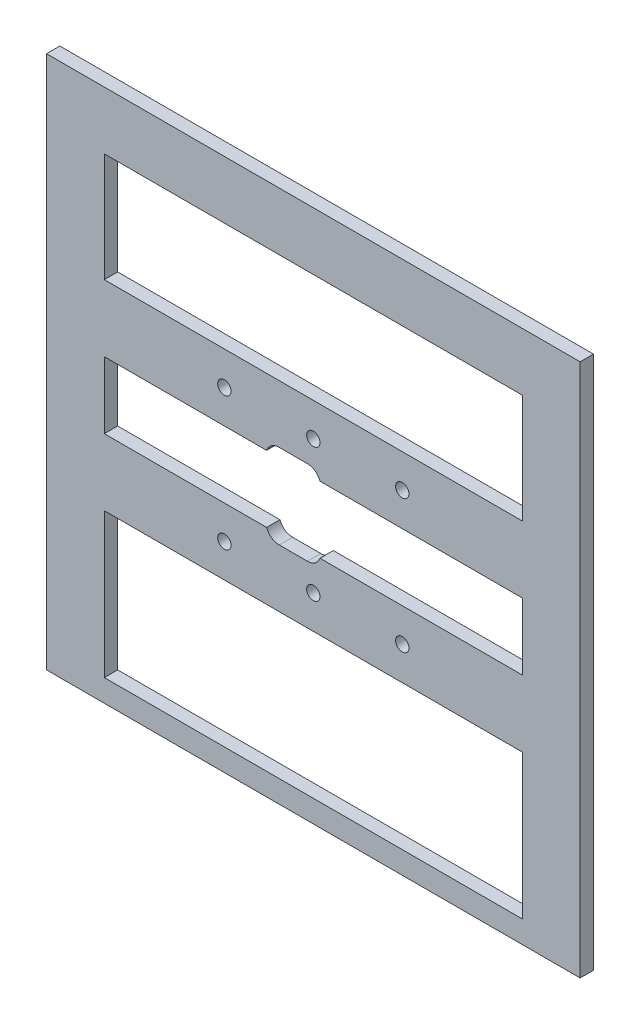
ISO-10303-21;
HEADER;
FILE_DESCRIPTION(('STEP AP214'),'2;1');
FILE_NAME('part.step','',(''),(''),'','','');
FILE_SCHEMA(('AUTOMOTIVE_DESIGN { 1 0 10303 214 1 1 1 1 }'));
ENDSEC;
DATA;
#1=APPLICATION_CONTEXT('core data for automotive mechanical design processes');
#2=APPLICATION_PROTOCOL_DEFINITION('international standard','automotive_design',2000,#1);
#3=PRODUCT_CONTEXT('',#1,'mechanical');
#4=PRODUCT('Part','Part','',(#3));
#5=PRODUCT_RELATED_PRODUCT_CATEGORY('part','',(#4));
#6=PRODUCT_DEFINITION_FORMATION('','',#4);
#7=PRODUCT_DEFINITION_CONTEXT('part definition',#1,'design');
#8=PRODUCT_DEFINITION('design','',#6,#7);
#9=PRODUCT_DEFINITION_SHAPE('','',#8);
#10=(LENGTH_UNIT() NAMED_UNIT(*) SI_UNIT(.MILLI.,.METRE.));
#11=(NAMED_UNIT(*) PLANE_ANGLE_UNIT() SI_UNIT($,.RADIAN.));
#12=(NAMED_UNIT(*) SI_UNIT($,.STERADIAN.) SOLID_ANGLE_UNIT());
#13=UNCERTAINTY_MEASURE_WITH_UNIT(LENGTH_MEASURE(1.E-05),#10,'distance_accuracy_value','');
#14=(GEOMETRIC_REPRESENTATION_CONTEXT(3) GLOBAL_UNCERTAINTY_ASSIGNED_CONTEXT((#13)) GLOBAL_UNIT_ASSIGNED_CONTEXT((#10,
#11,#12)) REPRESENTATION_CONTEXT('',''));
#15=CARTESIAN_POINT('',(0.,0.,0.));
#16=DIRECTION('',(0.,0.,1.));
#17=DIRECTION('',(1.,0.,0.));
#18=AXIS2_PLACEMENT_3D('',#15,#16,#17);
#19=CARTESIAN_POINT('',(-47.,7.5,0.));
#20=DIRECTION('',(0.,1.,0.));
#21=DIRECTION('',(0.,0.,1.));
#22=AXIS2_PLACEMENT_3D('',#19,#20,#21);
#23=PLANE('',#22);
#24=DIRECTION('',(-1.,0.,0.));
#25=VECTOR('',#24,1.);
#26=CARTESIAN_POINT('',(-47.,7.5,0.));
#27=LINE('',#26,#25);
#28=CARTESIAN_POINT('',(-10.5,7.5,0.));
#29=VERTEX_POINT('',#28);
#30=CARTESIAN_POINT('',(-47.,7.5,0.));
#31=VERTEX_POINT('',#30);
#32=EDGE_CURVE('E268',#29,#31,#27,.T.);
#33=ORIENTED_EDGE('',*,*,#32,.F.);
#34=DIRECTION('',(0.,0.,-1.));
#35=VECTOR('',#34,1.);
#36=CARTESIAN_POINT('',(-10.5,7.5,3.));
#37=LINE('',#36,#35);
#38=CARTESIAN_POINT('',(-10.5,7.5,3.));
#39=VERTEX_POINT('',#38);
#40=EDGE_CURVE('E248',#39,#29,#37,.T.);
#41=ORIENTED_EDGE('',*,*,#40,.F.);
#42=DIRECTION('',(-1.,0.,0.));
#43=VECTOR('',#42,1.);
#44=CARTESIAN_POINT('',(-47.,7.5,3.));
#45=LINE('',#44,#43);
#46=CARTESIAN_POINT('',(-47.,7.5,3.));
#47=VERTEX_POINT('',#46);
#48=EDGE_CURVE('E283',#39,#47,#45,.T.);
#49=ORIENTED_EDGE('',*,*,#48,.T.);
#50=DIRECTION('',(0.,0.,1.));
#51=VECTOR('',#50,1.);
#52=CARTESIAN_POINT('',(-47.,7.5,0.));
#53=LINE('',#52,#51);
#54=EDGE_CURVE('E300',#31,#47,#53,.T.);
#55=ORIENTED_EDGE('',*,*,#54,.F.);
#56=EDGE_LOOP('',(#33,#41,#49,#55));
#57=FACE_BOUND('',#56,.T.);
#58=ADVANCED_FACE('F35',(#57),#23,.F.);
#59=CARTESIAN_POINT('',(-47.,-7.5,0.));
#60=DIRECTION('',(0.,-1.,0.));
#61=DIRECTION('',(0.,0.,-1.));
#62=AXIS2_PLACEMENT_3D('',#59,#60,#61);
#63=PLANE('',#62);
#64=DIRECTION('',(1.,0.,0.));
#65=VECTOR('',#64,1.);
#66=CARTESIAN_POINT('',(-47.,-7.5,3.));
#67=LINE('',#66,#65);
#68=CARTESIAN_POINT('',(-47.,-7.5,3.));
#69=VERTEX_POINT('',#68);
#70=CARTESIAN_POINT('',(-10.5,-7.5,3.));
#71=VERTEX_POINT('',#70);
#72=EDGE_CURVE('E269',#69,#71,#67,.T.);
#73=ORIENTED_EDGE('',*,*,#72,.T.);
#74=DIRECTION('',(0.,0.,-1.));
#75=VECTOR('',#74,1.);
#76=CARTESIAN_POINT('',(-10.5,-7.5,3.));
#77=LINE('',#76,#75);
#78=CARTESIAN_POINT('',(-10.5,-7.5,0.));
#79=VERTEX_POINT('',#78);
#80=EDGE_CURVE('E257',#71,#79,#77,.T.);
#81=ORIENTED_EDGE('',*,*,#80,.T.);
#82=DIRECTION('',(1.,0.,0.));
#83=VECTOR('',#82,1.);
#84=CARTESIAN_POINT('',(-47.,-7.5,0.));
#85=LINE('',#84,#83);
#86=CARTESIAN_POINT('',(-47.,-7.5,0.));
#87=VERTEX_POINT('',#86);
#88=EDGE_CURVE('E277',#87,#79,#85,.T.);
#89=ORIENTED_EDGE('',*,*,#88,.F.);
#90=DIRECTION('',(0.,0.,1.));
#91=VECTOR('',#90,1.);
#92=CARTESIAN_POINT('',(-47.,-7.5,0.));
#93=LINE('',#92,#91);
#94=EDGE_CURVE('E298',#87,#69,#93,.T.);
#95=ORIENTED_EDGE('',*,*,#94,.T.);
#96=EDGE_LOOP('',(#73,#81,#89,#95));
#97=FACE_BOUND('',#96,.T.);
#98=ADVANCED_FACE('F451',(#97),#63,.F.);
#99=CARTESIAN_POINT('',(60.,60.,3.));
#100=DIRECTION('',(-1.,0.,0.));
#101=DIRECTION('',(0.,-1.,0.));
#102=AXIS2_PLACEMENT_3D('',#99,#100,#101);
#103=PLANE('',#102);
#104=DIRECTION('',(0.,1.,0.));
#105=VECTOR('',#104,1.);
#106=CARTESIAN_POINT('',(60.,60.,0.));
#107=LINE('',#106,#105);
#108=CARTESIAN_POINT('',(60.,-60.,0.));
#109=VERTEX_POINT('',#108);
#110=CARTESIAN_POINT('',(60.,60.,0.));
#111=VERTEX_POINT('',#110);
#112=EDGE_CURVE('E359',#109,#111,#107,.T.);
#113=ORIENTED_EDGE('',*,*,#112,.T.);
#114=DIRECTION('',(0.,0.,-1.));
#115=VECTOR('',#114,1.);
#116=CARTESIAN_POINT('',(60.,60.,3.));
#117=LINE('',#116,#115);
#118=CARTESIAN_POINT('',(60.,60.,3.));
#119=VERTEX_POINT('',#118);
#120=EDGE_CURVE('E386',#119,#111,#117,.T.);
#121=ORIENTED_EDGE('',*,*,#120,.F.);
#122=DIRECTION('',(0.,1.,0.));
#123=VECTOR('',#122,1.);
#124=CARTESIAN_POINT('',(60.,60.,3.));
#125=LINE('',#124,#123);
#126=CARTESIAN_POINT('',(60.,-60.,3.));
#127=VERTEX_POINT('',#126);
#128=EDGE_CURVE('E360',#127,#119,#125,.T.);
#129=ORIENTED_EDGE('',*,*,#128,.F.);
#130=DIRECTION('',(0.,0.,-1.));
#131=VECTOR('',#130,1.);
#132=CARTESIAN_POINT('',(60.,-60.,3.));
#133=LINE('',#132,#131);
#134=EDGE_CURVE('E370',#127,#109,#133,.T.);
#135=ORIENTED_EDGE('',*,*,#134,.T.);
#136=EDGE_LOOP('',(#113,#121,#129,#135));
#137=FACE_BOUND('',#136,.T.);
#138=ADVANCED_FACE('F469',(#137),#103,.F.);
#139=CARTESIAN_POINT('',(-60.,60.,3.));
#140=DIRECTION('',(0.,-1.,0.));
#141=DIRECTION('',(0.,0.,-1.));
#142=AXIS2_PLACEMENT_3D('',#139,#140,#141);
#143=PLANE('',#142);
#144=DIRECTION('',(-1.,0.,0.));
#145=VECTOR('',#144,1.);
#146=CARTESIAN_POINT('',(-60.,60.,0.));
#147=LINE('',#146,#145);
#148=CARTESIAN_POINT('',(-60.,60.,0.));
#149=VERTEX_POINT('',#148);
#150=EDGE_CURVE('E373',#111,#149,#147,.T.);
#151=ORIENTED_EDGE('',*,*,#150,.T.);
#152=DIRECTION('',(0.,0.,-1.));
#153=VECTOR('',#152,1.);
#154=CARTESIAN_POINT('',(-60.,60.,3.));
#155=LINE('',#154,#153);
#156=CARTESIAN_POINT('',(-60.,60.,3.));
#157=VERTEX_POINT('',#156);
#158=EDGE_CURVE('E383',#157,#149,#155,.T.);
#159=ORIENTED_EDGE('',*,*,#158,.F.);
#160=DIRECTION('',(-1.,0.,0.));
#161=VECTOR('',#160,1.);
#162=CARTESIAN_POINT('',(-60.,60.,3.));
#163=LINE('',#162,#161);
#164=EDGE_CURVE('E363',#119,#157,#163,.T.);
#165=ORIENTED_EDGE('',*,*,#164,.F.);
#166=ORIENTED_EDGE('',*,*,#120,.T.);
#167=EDGE_LOOP('',(#151,#159,#165,#166));
#168=FACE_BOUND('',#167,.T.);
#169=ADVANCED_FACE('F524',(#168),#143,.F.);
#170=CARTESIAN_POINT('',(-60.,60.,3.));
#171=DIRECTION('',(1.,0.,0.));
#172=DIRECTION('',(0.,1.,0.));
#173=AXIS2_PLACEMENT_3D('',#170,#171,#172);
#174=PLANE('',#173);
#175=DIRECTION('',(0.,-1.,0.));
#176=VECTOR('',#175,1.);
#177=CARTESIAN_POINT('',(-60.,60.,0.));
#178=LINE('',#177,#176);
#179=CARTESIAN_POINT('',(-60.,-60.,0.));
#180=VERTEX_POINT('',#179);
#181=EDGE_CURVE('E375',#149,#180,#178,.T.);
#182=ORIENTED_EDGE('',*,*,#181,.T.);
#183=DIRECTION('',(0.,0.,-1.));
#184=VECTOR('',#183,1.);
#185=CARTESIAN_POINT('',(-60.,-60.,3.));
#186=LINE('',#185,#184);
#187=CARTESIAN_POINT('',(-60.,-60.,3.));
#188=VERTEX_POINT('',#187);
#189=EDGE_CURVE('E380',#188,#180,#186,.T.);
#190=ORIENTED_EDGE('',*,*,#189,.F.);
#191=DIRECTION('',(0.,-1.,0.));
#192=VECTOR('',#191,1.);
#193=CARTESIAN_POINT('',(-60.,60.,3.));
#194=LINE('',#193,#192);
#195=EDGE_CURVE('E366',#157,#188,#194,.T.);
#196=ORIENTED_EDGE('',*,*,#195,.F.);
#197=ORIENTED_EDGE('',*,*,#158,.T.);
#198=EDGE_LOOP('',(#182,#190,#196,#197));
#199=FACE_BOUND('',#198,.T.);
#200=ADVANCED_FACE('F520',(#199),#174,.F.);
#201=CARTESIAN_POINT('',(-60.,-60.,3.));
#202=DIRECTION('',(0.,1.,0.));
#203=DIRECTION('',(0.,0.,1.));
#204=AXIS2_PLACEMENT_3D('',#201,#202,#203);
#205=PLANE('',#204);
#206=DIRECTION('',(1.,0.,0.));
#207=VECTOR('',#206,1.);
#208=CARTESIAN_POINT('',(-60.,-60.,0.));
#209=LINE('',#208,#207);
#210=EDGE_CURVE('E364',#180,#109,#209,.T.);
#211=ORIENTED_EDGE('',*,*,#210,.T.);
#212=ORIENTED_EDGE('',*,*,#134,.F.);
#213=DIRECTION('',(1.,0.,0.));
#214=VECTOR('',#213,1.);
#215=CARTESIAN_POINT('',(-60.,-60.,3.));
#216=LINE('',#215,#214);
#217=EDGE_CURVE('E368',#188,#127,#216,.T.);
#218=ORIENTED_EDGE('',*,*,#217,.F.);
#219=ORIENTED_EDGE('',*,*,#189,.T.);
#220=EDGE_LOOP('',(#211,#212,#218,#219));
#221=FACE_BOUND('',#220,.T.);
#222=ADVANCED_FACE('F513',(#221),#205,.F.);
#223=CARTESIAN_POINT('',(0.,0.,3.));
#224=DIRECTION('',(0.,0.,1.));
#225=DIRECTION('',(1.,0.,0.));
#226=AXIS2_PLACEMENT_3D('',#223,#224,#225);
#227=PLANE('',#226);
#228=CARTESIAN_POINT('',(0.,-15.,3.));
#229=DIRECTION('',(0.,0.,1.));
#230=DIRECTION('',(1.,0.,0.));
#231=AXIS2_PLACEMENT_3D('',#228,#229,#230);
#232=CIRCLE('',#231,1.49999999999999);
#233=CARTESIAN_POINT('',(1.49999999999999,-15.,3.));
#234=VERTEX_POINT('',#233);
#235=EDGE_CURVE('E659',#234,#234,#232,.T.);
#236=ORIENTED_EDGE('',*,*,#235,.F.);
#237=EDGE_LOOP('',(#236));
#238=FACE_BOUND('',#237,.T.);
#239=CARTESIAN_POINT('',(0.,15.,3.));
#240=DIRECTION('',(0.,0.,1.));
#241=DIRECTION('',(1.,0.,0.));
#242=AXIS2_PLACEMENT_3D('',#239,#240,#241);
#243=CIRCLE('',#242,1.49999999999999);
#244=CARTESIAN_POINT('',(1.49999999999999,15.,3.));
#245=VERTEX_POINT('',#244);
#246=EDGE_CURVE('E661',#245,#245,#243,.T.);
#247=ORIENTED_EDGE('',*,*,#246,.F.);
#248=EDGE_LOOP('',(#247));
#249=FACE_BOUND('',#248,.T.);
#250=DIRECTION('',(1.,0.,0.));
#251=VECTOR('',#250,1.);
#252=CARTESIAN_POINT('',(-47.,-55.,3.));
#253=LINE('',#252,#251);
#254=CARTESIAN_POINT('',(-47.,-55.,3.));
#255=VERTEX_POINT('',#254);
#256=CARTESIAN_POINT('',(47.,-55.,3.));
#257=VERTEX_POINT('',#256);
#258=EDGE_CURVE('E223',#255,#257,#253,.T.);
#259=ORIENTED_EDGE('',*,*,#258,.F.);
#260=DIRECTION('',(0.,-1.,0.));
#261=VECTOR('',#260,1.);
#262=CARTESIAN_POINT('',(-47.,-22.5,3.));
#263=LINE('',#262,#261);
#264=CARTESIAN_POINT('',(-47.,-22.5,3.));
#265=VERTEX_POINT('',#264);
#266=EDGE_CURVE('E214',#265,#255,#263,.T.);
#267=ORIENTED_EDGE('',*,*,#266,.F.);
#268=DIRECTION('',(-1.,0.,0.));
#269=VECTOR('',#268,1.);
#270=CARTESIAN_POINT('',(-47.,-22.5,3.));
#271=LINE('',#270,#269);
#272=CARTESIAN_POINT('',(47.,-22.5,3.));
#273=VERTEX_POINT('',#272);
#274=EDGE_CURVE('E208',#273,#265,#271,.T.);
#275=ORIENTED_EDGE('',*,*,#274,.F.);
#276=DIRECTION('',(0.,1.,0.));
#277=VECTOR('',#276,1.);
#278=CARTESIAN_POINT('',(47.,-22.5,3.));
#279=LINE('',#278,#277);
#280=EDGE_CURVE('E309',#257,#273,#279,.T.);
#281=ORIENTED_EDGE('',*,*,#280,.F.);
#282=EDGE_LOOP('',(#259,#267,#275,#281));
#283=FACE_BOUND('',#282,.T.);
#284=DIRECTION('',(1.,0.,0.));
#285=VECTOR('',#284,1.);
#286=CARTESIAN_POINT('',(47.,47.,3.));
#287=LINE('',#286,#285);
#288=CARTESIAN_POINT('',(-47.,47.,3.));
#289=VERTEX_POINT('',#288);
#290=CARTESIAN_POINT('',(47.,47.,3.));
#291=VERTEX_POINT('',#290);
#292=EDGE_CURVE('E232',#289,#291,#287,.T.);
#293=ORIENTED_EDGE('',*,*,#292,.T.);
#294=DIRECTION('',(0.,1.,0.));
#295=VECTOR('',#294,1.);
#296=CARTESIAN_POINT('',(47.,32.5,3.));
#297=LINE('',#296,#295);
#298=CARTESIAN_POINT('',(47.,22.5,3.));
#299=VERTEX_POINT('',#298);
#300=EDGE_CURVE('E320',#299,#291,#297,.T.);
#301=ORIENTED_EDGE('',*,*,#300,.F.);
#302=DIRECTION('',(1.,0.,0.));
#303=VECTOR('',#302,1.);
#304=CARTESIAN_POINT('',(-47.,22.5,3.));
#305=LINE('',#304,#303);
#306=CARTESIAN_POINT('',(-47.,22.5,3.));
#307=VERTEX_POINT('',#306);
#308=EDGE_CURVE('E327',#307,#299,#305,.T.);
#309=ORIENTED_EDGE('',*,*,#308,.F.);
#310=DIRECTION('',(0.,-1.,0.));
#311=VECTOR('',#310,1.);
#312=CARTESIAN_POINT('',(-47.,32.5,3.));
#313=LINE('',#312,#311);
#314=EDGE_CURVE('E297',#289,#307,#313,.T.);
#315=ORIENTED_EDGE('',*,*,#314,.F.);
#316=EDGE_LOOP('',(#293,#301,#309,#315));
#317=FACE_BOUND('',#316,.T.);
#318=ORIENTED_EDGE('',*,*,#48,.F.);
#319=CARTESIAN_POINT('',(-7.67157287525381,6.5,3.));
#320=DIRECTION('',(0.,0.,1.));
#321=DIRECTION('',(1.,0.,0.));
#322=AXIS2_PLACEMENT_3D('',#319,#320,#321);
#323=CIRCLE('',#322,3.);
#324=CARTESIAN_POINT('',(-7.67157287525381,9.5,3.));
#325=VERTEX_POINT('',#324);
#326=EDGE_CURVE('E11',#39,#325,#323,.F.);
#327=ORIENTED_EDGE('',*,*,#326,.T.);
#328=DIRECTION('',(1.,0.,0.));
#329=VECTOR('',#328,1.);
#330=CARTESIAN_POINT('',(-10.5,9.5,3.));
#331=LINE('',#330,#329);
#332=CARTESIAN_POINT('',(-1.32842712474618,9.5,3.));
#333=VERTEX_POINT('',#332);
#334=EDGE_CURVE('E244',#325,#333,#331,.T.);
#335=ORIENTED_EDGE('',*,*,#334,.T.);
#336=CARTESIAN_POINT('',(-1.32842712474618,6.5,3.));
#337=DIRECTION('',(0.,0.,1.));
#338=DIRECTION('',(1.,0.,0.));
#339=AXIS2_PLACEMENT_3D('',#336,#337,#338);
#340=CIRCLE('',#339,3.);
#341=CARTESIAN_POINT('',(1.5,7.5,3.));
#342=VERTEX_POINT('',#341);
#343=EDGE_CURVE('E408',#333,#342,#340,.F.);
#344=ORIENTED_EDGE('',*,*,#343,.T.);
#345=CARTESIAN_POINT('',(47.,7.5,3.));
#346=VERTEX_POINT('',#345);
#347=EDGE_CURVE('E285',#346,#342,#45,.T.);
#348=ORIENTED_EDGE('',*,*,#347,.F.);
#349=DIRECTION('',(0.,1.,0.));
#350=VECTOR('',#349,1.);
#351=CARTESIAN_POINT('',(47.,7.5,3.));
#352=LINE('',#351,#350);
#353=CARTESIAN_POINT('',(47.,-7.5,3.));
#354=VERTEX_POINT('',#353);
#355=EDGE_CURVE('E281',#354,#346,#352,.T.);
#356=ORIENTED_EDGE('',*,*,#355,.F.);
#357=CARTESIAN_POINT('',(1.5,-7.5,3.));
#358=VERTEX_POINT('',#357);
#359=EDGE_CURVE('E291',#358,#354,#67,.T.);
#360=ORIENTED_EDGE('',*,*,#359,.F.);
#361=CARTESIAN_POINT('',(-1.32842712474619,-6.5,3.));
#362=DIRECTION('',(0.,0.,1.));
#363=DIRECTION('',(1.,0.,0.));
#364=AXIS2_PLACEMENT_3D('',#361,#362,#363);
#365=CIRCLE('',#364,3.);
#366=CARTESIAN_POINT('',(-1.32842712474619,-9.5,3.));
#367=VERTEX_POINT('',#366);
#368=EDGE_CURVE('E400',#358,#367,#365,.F.);
#369=ORIENTED_EDGE('',*,*,#368,.T.);
#370=DIRECTION('',(-1.,0.,0.));
#371=VECTOR('',#370,1.);
#372=CARTESIAN_POINT('',(-10.5,-9.5,3.));
#373=LINE('',#372,#371);
#374=CARTESIAN_POINT('',(-7.6715728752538,-9.5,3.));
#375=VERTEX_POINT('',#374);
#376=EDGE_CURVE('E254',#367,#375,#373,.T.);
#377=ORIENTED_EDGE('',*,*,#376,.T.);
#378=CARTESIAN_POINT('',(-7.6715728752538,-6.5,3.));
#379=DIRECTION('',(0.,0.,1.));
#380=DIRECTION('',(1.,0.,0.));
#381=AXIS2_PLACEMENT_3D('',#378,#379,#380);
#382=CIRCLE('',#381,3.);
#383=EDGE_CURVE('E404',#375,#71,#382,.F.);
#384=ORIENTED_EDGE('',*,*,#383,.T.);
#385=ORIENTED_EDGE('',*,*,#72,.F.);
#386=DIRECTION('',(0.,-1.,0.));
#387=VECTOR('',#386,1.);
#388=CARTESIAN_POINT('',(-47.,7.5,3.));
#389=LINE('',#388,#387);
#390=EDGE_CURVE('E288',#47,#69,#389,.T.);
#391=ORIENTED_EDGE('',*,*,#390,.F.);
#392=EDGE_LOOP('',(#318,#327,#335,#344,#348,#356,#360,#369,#377,#384,#385,#391));
#393=FACE_BOUND('',#392,.T.);
#394=CARTESIAN_POINT('',(-20.,15.,3.));
#395=DIRECTION('',(0.,0.,1.));
#396=DIRECTION('',(1.,0.,0.));
#397=AXIS2_PLACEMENT_3D('',#394,#395,#396);
#398=CIRCLE('',#397,1.49999999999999);
#399=CARTESIAN_POINT('',(-18.5,15.,3.));
#400=VERTEX_POINT('',#399);
#401=EDGE_CURVE('E333',#400,#400,#398,.T.);
#402=ORIENTED_EDGE('',*,*,#401,.F.);
#403=EDGE_LOOP('',(#402));
#404=FACE_BOUND('',#403,.T.);
#405=CARTESIAN_POINT('',(-20.,-15.,3.));
#406=DIRECTION('',(0.,0.,1.));
#407=DIRECTION('',(1.,0.,0.));
#408=AXIS2_PLACEMENT_3D('',#405,#406,#407);
#409=CIRCLE('',#408,1.49999999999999);
#410=CARTESIAN_POINT('',(-18.5,-15.,3.));
#411=VERTEX_POINT('',#410);
#412=EDGE_CURVE('E341',#411,#411,#409,.T.);
#413=ORIENTED_EDGE('',*,*,#412,.F.);
#414=EDGE_LOOP('',(#413));
#415=FACE_BOUND('',#414,.T.);
#416=CARTESIAN_POINT('',(20.,-15.,3.));
#417=DIRECTION('',(0.,0.,1.));
#418=DIRECTION('',(1.,0.,0.));
#419=AXIS2_PLACEMENT_3D('',#416,#417,#418);
#420=CIRCLE('',#419,1.49999999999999);
#421=CARTESIAN_POINT('',(21.5,-15.,3.));
#422=VERTEX_POINT('',#421);
#423=EDGE_CURVE('E347',#422,#422,#420,.T.);
#424=ORIENTED_EDGE('',*,*,#423,.F.);
#425=EDGE_LOOP('',(#424));
#426=FACE_BOUND('',#425,.T.);
#427=CARTESIAN_POINT('',(20.,15.,3.));
#428=DIRECTION('',(0.,0.,1.));
#429=DIRECTION('',(1.,0.,0.));
#430=AXIS2_PLACEMENT_3D('',#427,#428,#429);
#431=CIRCLE('',#430,1.49999999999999);
#432=CARTESIAN_POINT('',(21.5,15.,3.));
#433=VERTEX_POINT('',#432);
#434=EDGE_CURVE('E353',#433,#433,#431,.T.);
#435=ORIENTED_EDGE('',*,*,#434,.F.);
#436=EDGE_LOOP('',(#435));
#437=FACE_BOUND('',#436,.T.);
#438=ORIENTED_EDGE('',*,*,#128,.T.);
#439=ORIENTED_EDGE('',*,*,#164,.T.);
#440=ORIENTED_EDGE('',*,*,#195,.T.);
#441=ORIENTED_EDGE('',*,*,#217,.T.);
#442=EDGE_LOOP('',(#438,#439,#440,#441));
#443=FACE_BOUND('',#442,.T.);
#444=ADVANCED_FACE('F419',(#238,#249,#283,#317,#393,#404,#415,#426,#437,#443),#227,.T.);
#445=CARTESIAN_POINT('',(0.,0.,0.));
#446=DIRECTION('',(0.,0.,1.));
#447=DIRECTION('',(1.,0.,0.));
#448=AXIS2_PLACEMENT_3D('',#445,#446,#447);
#449=PLANE('',#448);
#450=CARTESIAN_POINT('',(0.,-15.,0.));
#451=DIRECTION('',(0.,0.,1.));
#452=DIRECTION('',(1.,0.,0.));
#453=AXIS2_PLACEMENT_3D('',#450,#451,#452);
#454=CIRCLE('',#453,1.5);
#455=CARTESIAN_POINT('',(1.5,-15.,0.));
#456=VERTEX_POINT('',#455);
#457=EDGE_CURVE('E656',#456,#456,#454,.T.);
#458=ORIENTED_EDGE('',*,*,#457,.T.);
#459=EDGE_LOOP('',(#458));
#460=FACE_BOUND('',#459,.T.);
#461=CARTESIAN_POINT('',(0.,15.,0.));
#462=DIRECTION('',(0.,0.,1.));
#463=DIRECTION('',(1.,0.,0.));
#464=AXIS2_PLACEMENT_3D('',#461,#462,#463);
#465=CIRCLE('',#464,1.5);
#466=CARTESIAN_POINT('',(1.5,15.,0.));
#467=VERTEX_POINT('',#466);
#468=EDGE_CURVE('E225',#467,#467,#465,.T.);
#469=ORIENTED_EDGE('',*,*,#468,.T.);
#470=EDGE_LOOP('',(#469));
#471=FACE_BOUND('',#470,.T.);
#472=DIRECTION('',(0.,-1.,0.));
#473=VECTOR('',#472,1.);
#474=CARTESIAN_POINT('',(-47.,-22.5,0.));
#475=LINE('',#474,#473);
#476=CARTESIAN_POINT('',(-47.,-22.5,0.));
#477=VERTEX_POINT('',#476);
#478=CARTESIAN_POINT('',(-47.,-55.,0.));
#479=VERTEX_POINT('',#478);
#480=EDGE_CURVE('E197',#477,#479,#475,.T.);
#481=ORIENTED_EDGE('',*,*,#480,.T.);
#482=DIRECTION('',(1.,0.,0.));
#483=VECTOR('',#482,1.);
#484=CARTESIAN_POINT('',(-47.,-55.,0.));
#485=LINE('',#484,#483);
#486=CARTESIAN_POINT('',(47.,-55.,0.));
#487=VERTEX_POINT('',#486);
#488=EDGE_CURVE('E203',#479,#487,#485,.T.);
#489=ORIENTED_EDGE('',*,*,#488,.T.);
#490=DIRECTION('',(0.,1.,0.));
#491=VECTOR('',#490,1.);
#492=CARTESIAN_POINT('',(47.,-22.5,0.));
#493=LINE('',#492,#491);
#494=CARTESIAN_POINT('',(47.,-22.5,0.));
#495=VERTEX_POINT('',#494);
#496=EDGE_CURVE('E207',#487,#495,#493,.T.);
#497=ORIENTED_EDGE('',*,*,#496,.T.);
#498=DIRECTION('',(-1.,0.,0.));
#499=VECTOR('',#498,1.);
#500=CARTESIAN_POINT('',(-47.,-22.5,0.));
#501=LINE('',#500,#499);
#502=EDGE_CURVE('E205',#495,#477,#501,.T.);
#503=ORIENTED_EDGE('',*,*,#502,.T.);
#504=EDGE_LOOP('',(#481,#489,#497,#503));
#505=FACE_BOUND('',#504,.T.);
#506=DIRECTION('',(1.,0.,0.));
#507=VECTOR('',#506,1.);
#508=CARTESIAN_POINT('',(-10.5,9.5,0.));
#509=LINE('',#508,#507);
#510=CARTESIAN_POINT('',(-7.67157287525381,9.5,0.));
#511=VERTEX_POINT('',#510);
#512=CARTESIAN_POINT('',(-1.32842712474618,9.5,0.));
#513=VERTEX_POINT('',#512);
#514=EDGE_CURVE('E241',#511,#513,#509,.T.);
#515=ORIENTED_EDGE('',*,*,#514,.F.);
#516=CARTESIAN_POINT('',(-7.67157287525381,6.5,0.));
#517=DIRECTION('',(0.,0.,1.));
#518=DIRECTION('',(1.,0.,0.));
#519=AXIS2_PLACEMENT_3D('',#516,#517,#518);
#520=CIRCLE('',#519,3.);
#521=EDGE_CURVE('E43',#511,#29,#520,.T.);
#522=ORIENTED_EDGE('',*,*,#521,.T.);
#523=ORIENTED_EDGE('',*,*,#32,.T.);
#524=DIRECTION('',(0.,-1.,0.));
#525=VECTOR('',#524,1.);
#526=CARTESIAN_POINT('',(-47.,7.5,0.));
#527=LINE('',#526,#525);
#528=EDGE_CURVE('E273',#31,#87,#527,.T.);
#529=ORIENTED_EDGE('',*,*,#528,.T.);
#530=ORIENTED_EDGE('',*,*,#88,.T.);
#531=CARTESIAN_POINT('',(-7.6715728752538,-6.5,0.));
#532=DIRECTION('',(0.,0.,1.));
#533=DIRECTION('',(1.,0.,0.));
#534=AXIS2_PLACEMENT_3D('',#531,#532,#533);
#535=CIRCLE('',#534,3.);
#536=CARTESIAN_POINT('',(-7.6715728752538,-9.5,0.));
#537=VERTEX_POINT('',#536);
#538=EDGE_CURVE('E402',#79,#537,#535,.T.);
#539=ORIENTED_EDGE('',*,*,#538,.T.);
#540=DIRECTION('',(-1.,0.,0.));
#541=VECTOR('',#540,1.);
#542=CARTESIAN_POINT('',(-10.5,-9.5,0.));
#543=LINE('',#542,#541);
#544=CARTESIAN_POINT('',(-1.32842712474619,-9.5,0.));
#545=VERTEX_POINT('',#544);
#546=EDGE_CURVE('E251',#545,#537,#543,.T.);
#547=ORIENTED_EDGE('',*,*,#546,.F.);
#548=CARTESIAN_POINT('',(-1.32842712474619,-6.5,0.));
#549=DIRECTION('',(0.,0.,1.));
#550=DIRECTION('',(1.,0.,0.));
#551=AXIS2_PLACEMENT_3D('',#548,#549,#550);
#552=CIRCLE('',#551,3.);
#553=CARTESIAN_POINT('',(1.50000000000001,-7.5,0.));
#554=VERTEX_POINT('',#553);
#555=EDGE_CURVE('E398',#545,#554,#552,.T.);
#556=ORIENTED_EDGE('',*,*,#555,.T.);
#557=CARTESIAN_POINT('',(47.,-7.5,0.));
#558=VERTEX_POINT('',#557);
#559=EDGE_CURVE('E276',#554,#558,#85,.T.);
#560=ORIENTED_EDGE('',*,*,#559,.T.);
#561=DIRECTION('',(0.,1.,0.));
#562=VECTOR('',#561,1.);
#563=CARTESIAN_POINT('',(47.,7.5,0.));
#564=LINE('',#563,#562);
#565=CARTESIAN_POINT('',(47.,7.5,0.));
#566=VERTEX_POINT('',#565);
#567=EDGE_CURVE('E265',#558,#566,#564,.T.);
#568=ORIENTED_EDGE('',*,*,#567,.T.);
#569=CARTESIAN_POINT('',(1.5,7.5,0.));
#570=VERTEX_POINT('',#569);
#571=EDGE_CURVE('E270',#566,#570,#27,.T.);
#572=ORIENTED_EDGE('',*,*,#571,.T.);
#573=CARTESIAN_POINT('',(-1.32842712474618,6.5,0.));
#574=DIRECTION('',(0.,0.,1.));
#575=DIRECTION('',(1.,0.,0.));
#576=AXIS2_PLACEMENT_3D('',#573,#574,#575);
#577=CIRCLE('',#576,3.);
#578=EDGE_CURVE('E406',#570,#513,#577,.T.);
#579=ORIENTED_EDGE('',*,*,#578,.T.);
#580=EDGE_LOOP('',(#515,#522,#523,#529,#530,#539,#547,#556,#560,#568,#572,#579));
#581=FACE_BOUND('',#580,.T.);
#582=DIRECTION('',(0.,1.,0.));
#583=VECTOR('',#582,1.);
#584=CARTESIAN_POINT('',(47.,32.5,0.));
#585=LINE('',#584,#583);
#586=CARTESIAN_POINT('',(47.,22.5,0.));
#587=VERTEX_POINT('',#586);
#588=CARTESIAN_POINT('',(47.,47.,0.));
#589=VERTEX_POINT('',#588);
#590=EDGE_CURVE('E323',#587,#589,#585,.T.);
#591=ORIENTED_EDGE('',*,*,#590,.T.);
#592=DIRECTION('',(1.,0.,0.));
#593=VECTOR('',#592,1.);
#594=CARTESIAN_POINT('',(47.,47.,0.));
#595=LINE('',#594,#593);
#596=CARTESIAN_POINT('',(-47.,47.,0.));
#597=VERTEX_POINT('',#596);
#598=EDGE_CURVE('E230',#597,#589,#595,.T.);
#599=ORIENTED_EDGE('',*,*,#598,.F.);
#600=DIRECTION('',(0.,-1.,0.));
#601=VECTOR('',#600,1.);
#602=CARTESIAN_POINT('',(-47.,32.5,0.));
#603=LINE('',#602,#601);
#604=CARTESIAN_POINT('',(-47.,22.5,0.));
#605=VERTEX_POINT('',#604);
#606=EDGE_CURVE('E316',#597,#605,#603,.T.);
#607=ORIENTED_EDGE('',*,*,#606,.T.);
#608=DIRECTION('',(1.,0.,0.));
#609=VECTOR('',#608,1.);
#610=CARTESIAN_POINT('',(-47.,22.5,0.));
#611=LINE('',#610,#609);
#612=EDGE_CURVE('E319',#605,#587,#611,.T.);
#613=ORIENTED_EDGE('',*,*,#612,.T.);
#614=EDGE_LOOP('',(#591,#599,#607,#613));
#615=FACE_BOUND('',#614,.T.);
#616=CARTESIAN_POINT('',(-20.,15.,0.));
#617=DIRECTION('',(0.,0.,1.));
#618=DIRECTION('',(1.,0.,0.));
#619=AXIS2_PLACEMENT_3D('',#616,#617,#618);
#620=CIRCLE('',#619,1.5);
#621=CARTESIAN_POINT('',(-18.5,15.,0.));
#622=VERTEX_POINT('',#621);
#623=EDGE_CURVE('E338',#622,#622,#620,.T.);
#624=ORIENTED_EDGE('',*,*,#623,.T.);
#625=EDGE_LOOP('',(#624));
#626=FACE_BOUND('',#625,.T.);
#627=CARTESIAN_POINT('',(-20.,-15.,0.));
#628=DIRECTION('',(0.,0.,1.));
#629=DIRECTION('',(1.,0.,0.));
#630=AXIS2_PLACEMENT_3D('',#627,#628,#629);
#631=CIRCLE('',#630,1.5);
#632=CARTESIAN_POINT('',(-18.5,-15.,0.));
#633=VERTEX_POINT('',#632);
#634=EDGE_CURVE('E344',#633,#633,#631,.T.);
#635=ORIENTED_EDGE('',*,*,#634,.T.);
#636=EDGE_LOOP('',(#635));
#637=FACE_BOUND('',#636,.T.);
#638=CARTESIAN_POINT('',(20.,-15.,0.));
#639=DIRECTION('',(0.,0.,1.));
#640=DIRECTION('',(1.,0.,0.));
#641=AXIS2_PLACEMENT_3D('',#638,#639,#640);
#642=CIRCLE('',#641,1.5);
#643=CARTESIAN_POINT('',(21.5,-15.,0.));
#644=VERTEX_POINT('',#643);
#645=EDGE_CURVE('E350',#644,#644,#642,.T.);
#646=ORIENTED_EDGE('',*,*,#645,.T.);
#647=EDGE_LOOP('',(#646));
#648=FACE_BOUND('',#647,.T.);
#649=CARTESIAN_POINT('',(20.,15.,0.));
#650=DIRECTION('',(0.,0.,1.));
#651=DIRECTION('',(1.,0.,0.));
#652=AXIS2_PLACEMENT_3D('',#649,#650,#651);
#653=CIRCLE('',#652,1.5);
#654=CARTESIAN_POINT('',(21.5,15.,0.));
#655=VERTEX_POINT('',#654);
#656=EDGE_CURVE('E356',#655,#655,#653,.T.);
#657=ORIENTED_EDGE('',*,*,#656,.T.);
#658=EDGE_LOOP('',(#657));
#659=FACE_BOUND('',#658,.T.);
#660=ORIENTED_EDGE('',*,*,#112,.F.);
#661=ORIENTED_EDGE('',*,*,#210,.F.);
#662=ORIENTED_EDGE('',*,*,#181,.F.);
#663=ORIENTED_EDGE('',*,*,#150,.F.);
#664=EDGE_LOOP('',(#660,#661,#662,#663));
#665=FACE_BOUND('',#664,.T.);
#666=ADVANCED_FACE('F199',(#460,#471,#505,#581,#615,#626,#637,#648,#659,#665),#449,.F.);
#667=CARTESIAN_POINT('',(20.,15.,3.));
#668=DIRECTION('',(0.,0.,1.));
#669=DIRECTION('',(1.,0.,0.));
#670=AXIS2_PLACEMENT_3D('',#667,#668,#669);
#671=CYLINDRICAL_SURFACE('',#670,1.49999999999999);
#672=ORIENTED_EDGE('',*,*,#656,.F.);
#673=EDGE_LOOP('',(#672));
#674=FACE_BOUND('',#673,.T.);
#675=ORIENTED_EDGE('',*,*,#434,.T.);
#676=EDGE_LOOP('',(#675));
#677=FACE_BOUND('',#676,.T.);
#678=ADVANCED_FACE('F506',(#674,#677),#671,.F.);
#679=CARTESIAN_POINT('',(20.,-15.,3.));
#680=DIRECTION('',(0.,0.,1.));
#681=DIRECTION('',(1.,0.,0.));
#682=AXIS2_PLACEMENT_3D('',#679,#680,#681);
#683=CYLINDRICAL_SURFACE('',#682,1.49999999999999);
#684=ORIENTED_EDGE('',*,*,#645,.F.);
#685=EDGE_LOOP('',(#684));
#686=FACE_BOUND('',#685,.T.);
#687=ORIENTED_EDGE('',*,*,#423,.T.);
#688=EDGE_LOOP('',(#687));
#689=FACE_BOUND('',#688,.T.);
#690=ADVANCED_FACE('F502',(#686,#689),#683,.F.);
#691=CARTESIAN_POINT('',(-20.,-15.,3.));
#692=DIRECTION('',(0.,0.,1.));
#693=DIRECTION('',(1.,0.,0.));
#694=AXIS2_PLACEMENT_3D('',#691,#692,#693);
#695=CYLINDRICAL_SURFACE('',#694,1.49999999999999);
#696=ORIENTED_EDGE('',*,*,#634,.F.);
#697=EDGE_LOOP('',(#696));
#698=FACE_BOUND('',#697,.T.);
#699=ORIENTED_EDGE('',*,*,#412,.T.);
#700=EDGE_LOOP('',(#699));
#701=FACE_BOUND('',#700,.T.);
#702=ADVANCED_FACE('F498',(#698,#701),#695,.F.);
#703=CARTESIAN_POINT('',(-20.,15.,3.));
#704=DIRECTION('',(0.,0.,1.));
#705=DIRECTION('',(1.,0.,0.));
#706=AXIS2_PLACEMENT_3D('',#703,#704,#705);
#707=CYLINDRICAL_SURFACE('',#706,1.49999999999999);
#708=ORIENTED_EDGE('',*,*,#623,.F.);
#709=EDGE_LOOP('',(#708));
#710=FACE_BOUND('',#709,.T.);
#711=ORIENTED_EDGE('',*,*,#401,.T.);
#712=EDGE_LOOP('',(#711));
#713=FACE_BOUND('',#712,.T.);
#714=ADVANCED_FACE('F494',(#710,#713),#707,.F.);
#715=CARTESIAN_POINT('',(-47.,32.5,0.));
#716=DIRECTION('',(-1.,0.,0.));
#717=DIRECTION('',(0.,-1.,0.));
#718=AXIS2_PLACEMENT_3D('',#715,#716,#717);
#719=PLANE('',#718);
#720=ORIENTED_EDGE('',*,*,#314,.T.);
#721=DIRECTION('',(0.,0.,1.));
#722=VECTOR('',#721,1.);
#723=CARTESIAN_POINT('',(-47.,22.5,0.));
#724=LINE('',#723,#722);
#725=EDGE_CURVE('E325',#605,#307,#724,.T.);
#726=ORIENTED_EDGE('',*,*,#725,.F.);
#727=ORIENTED_EDGE('',*,*,#606,.F.);
#728=DIRECTION('',(0.,0.,-1.));
#729=VECTOR('',#728,1.);
#730=CARTESIAN_POINT('',(-47.,47.,3.));
#731=LINE('',#730,#729);
#732=EDGE_CURVE('E235',#289,#597,#731,.T.);
#733=ORIENTED_EDGE('',*,*,#732,.F.);
#734=EDGE_LOOP('',(#720,#726,#727,#733));
#735=FACE_BOUND('',#734,.T.);
#736=ADVANCED_FACE('F487',(#735),#719,.F.);
#737=CARTESIAN_POINT('',(47.,32.5,0.));
#738=DIRECTION('',(1.,0.,0.));
#739=DIRECTION('',(0.,0.,-1.));
#740=AXIS2_PLACEMENT_3D('',#737,#738,#739);
#741=PLANE('',#740);
#742=ORIENTED_EDGE('',*,*,#300,.T.);
#743=DIRECTION('',(0.,0.,-1.));
#744=VECTOR('',#743,1.);
#745=CARTESIAN_POINT('',(47.,47.,3.));
#746=LINE('',#745,#744);
#747=EDGE_CURVE('E238',#291,#589,#746,.T.);
#748=ORIENTED_EDGE('',*,*,#747,.T.);
#749=ORIENTED_EDGE('',*,*,#590,.F.);
#750=DIRECTION('',(0.,0.,1.));
#751=VECTOR('',#750,1.);
#752=CARTESIAN_POINT('',(47.,22.5,0.));
#753=LINE('',#752,#751);
#754=EDGE_CURVE('E331',#587,#299,#753,.T.);
#755=ORIENTED_EDGE('',*,*,#754,.T.);
#756=EDGE_LOOP('',(#742,#748,#749,#755));
#757=FACE_BOUND('',#756,.T.);
#758=ADVANCED_FACE('F484',(#757),#741,.F.);
#759=CARTESIAN_POINT('',(-47.,22.5,0.));
#760=DIRECTION('',(0.,-1.,0.));
#761=DIRECTION('',(0.,0.,-1.));
#762=AXIS2_PLACEMENT_3D('',#759,#760,#761);
#763=PLANE('',#762);
#764=ORIENTED_EDGE('',*,*,#308,.T.);
#765=ORIENTED_EDGE('',*,*,#754,.F.);
#766=ORIENTED_EDGE('',*,*,#612,.F.);
#767=ORIENTED_EDGE('',*,*,#725,.T.);
#768=EDGE_LOOP('',(#764,#765,#766,#767));
#769=FACE_BOUND('',#768,.T.);
#770=ADVANCED_FACE('F483',(#769),#763,.F.);
#771=CARTESIAN_POINT('',(-47.,-22.5,0.));
#772=DIRECTION('',(-1.,0.,0.));
#773=DIRECTION('',(0.,0.,1.));
#774=AXIS2_PLACEMENT_3D('',#771,#772,#773);
#775=PLANE('',#774);
#776=ORIENTED_EDGE('',*,*,#266,.T.);
#777=DIRECTION('',(0.,0.,1.));
#778=VECTOR('',#777,1.);
#779=CARTESIAN_POINT('',(-47.,-55.,0.));
#780=LINE('',#779,#778);
#781=EDGE_CURVE('E211',#479,#255,#780,.T.);
#782=ORIENTED_EDGE('',*,*,#781,.F.);
#783=ORIENTED_EDGE('',*,*,#480,.F.);
#784=DIRECTION('',(0.,0.,1.));
#785=VECTOR('',#784,1.);
#786=CARTESIAN_POINT('',(-47.,-22.5,0.));
#787=LINE('',#786,#785);
#788=EDGE_CURVE('E284',#477,#265,#787,.T.);
#789=ORIENTED_EDGE('',*,*,#788,.T.);
#790=EDGE_LOOP('',(#776,#782,#783,#789));
#791=FACE_BOUND('',#790,.T.);
#792=ADVANCED_FACE('F212',(#791),#775,.F.);
#793=CARTESIAN_POINT('',(-47.,-22.5,0.));
#794=DIRECTION('',(0.,1.,0.));
#795=DIRECTION('',(0.,0.,1.));
#796=AXIS2_PLACEMENT_3D('',#793,#794,#795);
#797=PLANE('',#796);
#798=ORIENTED_EDGE('',*,*,#274,.T.);
#799=ORIENTED_EDGE('',*,*,#788,.F.);
#800=ORIENTED_EDGE('',*,*,#502,.F.);
#801=DIRECTION('',(0.,0.,1.));
#802=VECTOR('',#801,1.);
#803=CARTESIAN_POINT('',(47.,-22.5,0.));
#804=LINE('',#803,#802);
#805=EDGE_CURVE('E307',#495,#273,#804,.T.);
#806=ORIENTED_EDGE('',*,*,#805,.T.);
#807=EDGE_LOOP('',(#798,#799,#800,#806));
#808=FACE_BOUND('',#807,.T.);
#809=ADVANCED_FACE('F474',(#808),#797,.F.);
#810=CARTESIAN_POINT('',(47.,-22.5,0.));
#811=DIRECTION('',(1.,0.,0.));
#812=DIRECTION('',(0.,0.,-1.));
#813=AXIS2_PLACEMENT_3D('',#810,#811,#812);
#814=PLANE('',#813);
#815=ORIENTED_EDGE('',*,*,#280,.T.);
#816=ORIENTED_EDGE('',*,*,#805,.F.);
#817=ORIENTED_EDGE('',*,*,#496,.F.);
#818=DIRECTION('',(0.,0.,1.));
#819=VECTOR('',#818,1.);
#820=CARTESIAN_POINT('',(47.,-55.,0.));
#821=LINE('',#820,#819);
#822=EDGE_CURVE('E218',#487,#257,#821,.T.);
#823=ORIENTED_EDGE('',*,*,#822,.T.);
#824=EDGE_LOOP('',(#815,#816,#817,#823));
#825=FACE_BOUND('',#824,.T.);
#826=ADVANCED_FACE('F473',(#825),#814,.F.);
#827=CARTESIAN_POINT('',(47.,7.5,0.));
#828=DIRECTION('',(1.,0.,0.));
#829=DIRECTION('',(0.,0.,-1.));
#830=AXIS2_PLACEMENT_3D('',#827,#828,#829);
#831=PLANE('',#830);
#832=ORIENTED_EDGE('',*,*,#355,.T.);
#833=DIRECTION('',(0.,0.,1.));
#834=VECTOR('',#833,1.);
#835=CARTESIAN_POINT('',(47.,7.5,0.));
#836=LINE('',#835,#834);
#837=EDGE_CURVE('E280',#566,#346,#836,.T.);
#838=ORIENTED_EDGE('',*,*,#837,.F.);
#839=ORIENTED_EDGE('',*,*,#567,.F.);
#840=DIRECTION('',(0.,0.,1.));
#841=VECTOR('',#840,1.);
#842=CARTESIAN_POINT('',(47.,-7.5,0.));
#843=LINE('',#842,#841);
#844=EDGE_CURVE('E294',#558,#354,#843,.T.);
#845=ORIENTED_EDGE('',*,*,#844,.T.);
#846=EDGE_LOOP('',(#832,#838,#839,#845));
#847=FACE_BOUND('',#846,.T.);
#848=ADVANCED_FACE('F432',(#847),#831,.F.);
#849=ORIENTED_EDGE('',*,*,#559,.F.);
#850=DIRECTION('',(0.,0.,-1.));
#851=VECTOR('',#850,1.);
#852=CARTESIAN_POINT('',(1.50000000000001,-7.5,3.));
#853=LINE('',#852,#851);
#854=EDGE_CURVE('E260',#358,#554,#853,.T.);
#855=ORIENTED_EDGE('',*,*,#854,.F.);
#856=ORIENTED_EDGE('',*,*,#359,.T.);
#857=ORIENTED_EDGE('',*,*,#844,.F.);
#858=EDGE_LOOP('',(#849,#855,#856,#857));
#859=FACE_BOUND('',#858,.T.);
#860=ADVANCED_FACE('F457',(#859),#63,.F.);
#861=CARTESIAN_POINT('',(-47.,7.5,0.));
#862=DIRECTION('',(-1.,0.,0.));
#863=DIRECTION('',(0.,0.,1.));
#864=AXIS2_PLACEMENT_3D('',#861,#862,#863);
#865=PLANE('',#864);
#866=ORIENTED_EDGE('',*,*,#390,.T.);
#867=ORIENTED_EDGE('',*,*,#94,.F.);
#868=ORIENTED_EDGE('',*,*,#528,.F.);
#869=ORIENTED_EDGE('',*,*,#54,.T.);
#870=EDGE_LOOP('',(#866,#867,#868,#869));
#871=FACE_BOUND('',#870,.T.);
#872=ADVANCED_FACE('F455',(#871),#865,.F.);
#873=ORIENTED_EDGE('',*,*,#347,.T.);
#874=DIRECTION('',(0.,0.,-1.));
#875=VECTOR('',#874,1.);
#876=CARTESIAN_POINT('',(1.5,7.5,3.));
#877=LINE('',#876,#875);
#878=EDGE_CURVE('E246',#342,#570,#877,.T.);
#879=ORIENTED_EDGE('',*,*,#878,.T.);
#880=ORIENTED_EDGE('',*,*,#571,.F.);
#881=ORIENTED_EDGE('',*,*,#837,.T.);
#882=EDGE_LOOP('',(#873,#879,#880,#881));
#883=FACE_BOUND('',#882,.T.);
#884=ADVANCED_FACE('F427',(#883),#23,.F.);
#885=CARTESIAN_POINT('',(-10.5,-9.5,3.));
#886=DIRECTION('',(0.,-1.,0.));
#887=DIRECTION('',(0.,0.,-1.));
#888=AXIS2_PLACEMENT_3D('',#885,#886,#887);
#889=PLANE('',#888);
#890=ORIENTED_EDGE('',*,*,#376,.F.);
#891=DIRECTION('',(0.,0.,-1.));
#892=VECTOR('',#891,1.);
#893=CARTESIAN_POINT('',(-1.32842712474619,-9.5,3.));
#894=LINE('',#893,#892);
#895=EDGE_CURVE('E391',#367,#545,#894,.T.);
#896=ORIENTED_EDGE('',*,*,#895,.T.);
#897=ORIENTED_EDGE('',*,*,#546,.T.);
#898=DIRECTION('',(0.,0.,1.));
#899=VECTOR('',#898,1.);
#900=CARTESIAN_POINT('',(-7.6715728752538,-9.5,3.));
#901=LINE('',#900,#899);
#902=EDGE_CURVE('E389',#537,#375,#901,.T.);
#903=ORIENTED_EDGE('',*,*,#902,.T.);
#904=EDGE_LOOP('',(#890,#896,#897,#903));
#905=FACE_BOUND('',#904,.T.);
#906=ADVANCED_FACE('F443',(#905),#889,.F.);
#907=CARTESIAN_POINT('',(-10.5,9.5,3.));
#908=DIRECTION('',(0.,1.,0.));
#909=DIRECTION('',(-1.,0.,0.));
#910=AXIS2_PLACEMENT_3D('',#907,#908,#909);
#911=PLANE('',#910);
#912=ORIENTED_EDGE('',*,*,#514,.T.);
#913=DIRECTION('',(0.,0.,1.));
#914=VECTOR('',#913,1.);
#915=CARTESIAN_POINT('',(-1.32842712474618,9.5,3.));
#916=LINE('',#915,#914);
#917=EDGE_CURVE('E50',#513,#333,#916,.T.);
#918=ORIENTED_EDGE('',*,*,#917,.T.);
#919=ORIENTED_EDGE('',*,*,#334,.F.);
#920=DIRECTION('',(0.,0.,-1.));
#921=VECTOR('',#920,1.);
#922=CARTESIAN_POINT('',(-7.67157287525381,9.5,3.));
#923=LINE('',#922,#921);
#924=EDGE_CURVE('E394',#325,#511,#923,.T.);
#925=ORIENTED_EDGE('',*,*,#924,.T.);
#926=EDGE_LOOP('',(#912,#918,#919,#925));
#927=FACE_BOUND('',#926,.T.);
#928=ADVANCED_FACE('F417',(#927),#911,.F.);
#929=CARTESIAN_POINT('',(-1.32842712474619,-6.5,3.));
#930=DIRECTION('',(0.,0.,-1.));
#931=DIRECTION('',(-1.,0.,0.));
#932=AXIS2_PLACEMENT_3D('',#929,#930,#931);
#933=CYLINDRICAL_SURFACE('',#932,3.);
#934=ORIENTED_EDGE('',*,*,#368,.F.);
#935=ORIENTED_EDGE('',*,*,#854,.T.);
#936=ORIENTED_EDGE('',*,*,#555,.F.);
#937=ORIENTED_EDGE('',*,*,#895,.F.);
#938=EDGE_LOOP('',(#934,#935,#936,#937));
#939=FACE_BOUND('',#938,.T.);
#940=ADVANCED_FACE('F440',(#939),#933,.F.);
#941=CARTESIAN_POINT('',(-7.6715728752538,-6.5,3.));
#942=DIRECTION('',(0.,0.,1.));
#943=DIRECTION('',(1.,0.,0.));
#944=AXIS2_PLACEMENT_3D('',#941,#942,#943);
#945=CYLINDRICAL_SURFACE('',#944,3.);
#946=ORIENTED_EDGE('',*,*,#383,.F.);
#947=ORIENTED_EDGE('',*,*,#902,.F.);
#948=ORIENTED_EDGE('',*,*,#538,.F.);
#949=ORIENTED_EDGE('',*,*,#80,.F.);
#950=EDGE_LOOP('',(#946,#947,#948,#949));
#951=FACE_BOUND('',#950,.T.);
#952=ADVANCED_FACE('F449',(#951),#945,.F.);
#953=CARTESIAN_POINT('',(-1.32842712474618,6.5,3.));
#954=DIRECTION('',(0.,0.,1.));
#955=DIRECTION('',(1.,0.,0.));
#956=AXIS2_PLACEMENT_3D('',#953,#954,#955);
#957=CYLINDRICAL_SURFACE('',#956,3.);
#958=ORIENTED_EDGE('',*,*,#343,.F.);
#959=ORIENTED_EDGE('',*,*,#917,.F.);
#960=ORIENTED_EDGE('',*,*,#578,.F.);
#961=ORIENTED_EDGE('',*,*,#878,.F.);
#962=EDGE_LOOP('',(#958,#959,#960,#961));
#963=FACE_BOUND('',#962,.T.);
#964=ADVANCED_FACE('F424',(#963),#957,.F.);
#965=CARTESIAN_POINT('',(-7.67157287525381,6.5,3.));
#966=DIRECTION('',(0.,0.,-1.));
#967=DIRECTION('',(-1.,0.,0.));
#968=AXIS2_PLACEMENT_3D('',#965,#966,#967);
#969=CYLINDRICAL_SURFACE('',#968,3.);
#970=ORIENTED_EDGE('',*,*,#326,.F.);
#971=ORIENTED_EDGE('',*,*,#40,.T.);
#972=ORIENTED_EDGE('',*,*,#521,.F.);
#973=ORIENTED_EDGE('',*,*,#924,.F.);
#974=EDGE_LOOP('',(#970,#971,#972,#973));
#975=FACE_BOUND('',#974,.T.);
#976=ADVANCED_FACE('F37',(#975),#969,.F.);
#977=CARTESIAN_POINT('',(47.,47.,3.));
#978=DIRECTION('',(0.,1.,0.));
#979=DIRECTION('',(-1.,0.,0.));
#980=AXIS2_PLACEMENT_3D('',#977,#978,#979);
#981=PLANE('',#980);
#982=ORIENTED_EDGE('',*,*,#598,.T.);
#983=ORIENTED_EDGE('',*,*,#747,.F.);
#984=ORIENTED_EDGE('',*,*,#292,.F.);
#985=ORIENTED_EDGE('',*,*,#732,.T.);
#986=EDGE_LOOP('',(#982,#983,#984,#985));
#987=FACE_BOUND('',#986,.T.);
#988=ADVANCED_FACE('F539',(#987),#981,.F.);
#989=CARTESIAN_POINT('',(-47.,-55.,0.));
#990=DIRECTION('',(0.,-1.,0.));
#991=DIRECTION('',(0.,0.,-1.));
#992=AXIS2_PLACEMENT_3D('',#989,#990,#991);
#993=PLANE('',#992);
#994=ORIENTED_EDGE('',*,*,#258,.T.);
#995=ORIENTED_EDGE('',*,*,#822,.F.);
#996=ORIENTED_EDGE('',*,*,#488,.F.);
#997=ORIENTED_EDGE('',*,*,#781,.T.);
#998=EDGE_LOOP('',(#994,#995,#996,#997));
#999=FACE_BOUND('',#998,.T.);
#1000=ADVANCED_FACE('F221',(#999),#993,.F.);
#1001=CARTESIAN_POINT('',(0.,15.,3.));
#1002=DIRECTION('',(0.,0.,1.));
#1003=DIRECTION('',(1.,0.,0.));
#1004=AXIS2_PLACEMENT_3D('',#1001,#1002,#1003);
#1005=CYLINDRICAL_SURFACE('',#1004,1.49999999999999);
#1006=ORIENTED_EDGE('',*,*,#468,.F.);
#1007=EDGE_LOOP('',(#1006));
#1008=FACE_BOUND('',#1007,.T.);
#1009=ORIENTED_EDGE('',*,*,#246,.T.);
#1010=EDGE_LOOP('',(#1009));
#1011=FACE_BOUND('',#1010,.T.);
#1012=ADVANCED_FACE('F548',(#1008,#1011),#1005,.F.);
#1013=CARTESIAN_POINT('',(0.,-15.,3.));
#1014=DIRECTION('',(0.,0.,1.));
#1015=DIRECTION('',(1.,0.,0.));
#1016=AXIS2_PLACEMENT_3D('',#1013,#1014,#1015);
#1017=CYLINDRICAL_SURFACE('',#1016,1.49999999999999);
#1018=ORIENTED_EDGE('',*,*,#457,.F.);
#1019=EDGE_LOOP('',(#1018));
#1020=FACE_BOUND('',#1019,.T.);
#1021=ORIENTED_EDGE('',*,*,#235,.T.);
#1022=EDGE_LOOP('',(#1021));
#1023=FACE_BOUND('',#1022,.T.);
#1024=ADVANCED_FACE('F640',(#1020,#1023),#1017,.F.);
#1025=CLOSED_SHELL('',(#58,#98,#138,#169,#200,#222,#444,#666,#678,#690,#702,#714,#736,#758,#770,
#792,#809,#826,#848,#860,#872,#884,#906,#928,#940,#952,#964,#976,#988,#1000,#1012,#1024));
#1026=MANIFOLD_SOLID_BREP('B2',#1025);
#1027=ADVANCED_BREP_SHAPE_REPRESENTATION('',(#18,#1026),#14);
#1028=SHAPE_DEFINITION_REPRESENTATION(#9,#1027);
ENDSEC;
END-ISO-10303-21;
